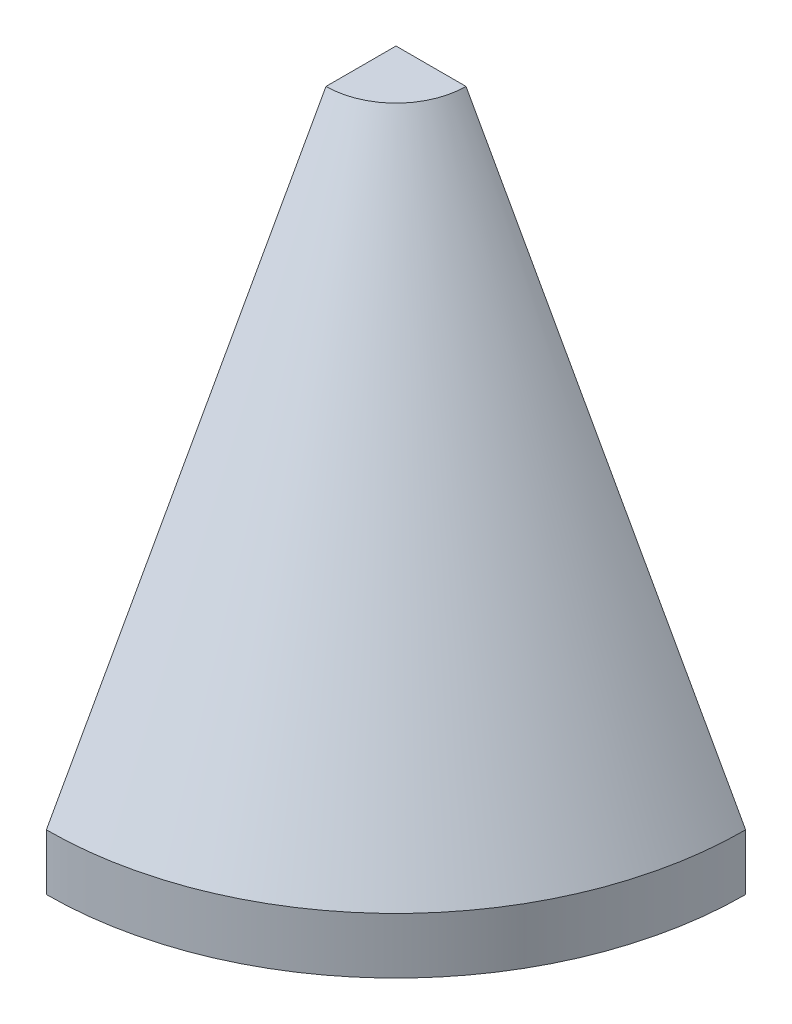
from build123d import *

# Parameters (mm, degrees)
REVOLVE1_ANGLE = 90


with BuildPart() as part:
    # Sketch1 → Revolve1 (revolve)
    with BuildSketch(Plane.XY):
        Polygon((25, 200), (124.879785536, 20), (124.879785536, 0), (0, 0), (0, 200), align=None)
    revolve(axis=Axis((0, 0, 0), (0, -1, 0)), revolution_arc=REVOLVE1_ANGLE)


solid = part.part
